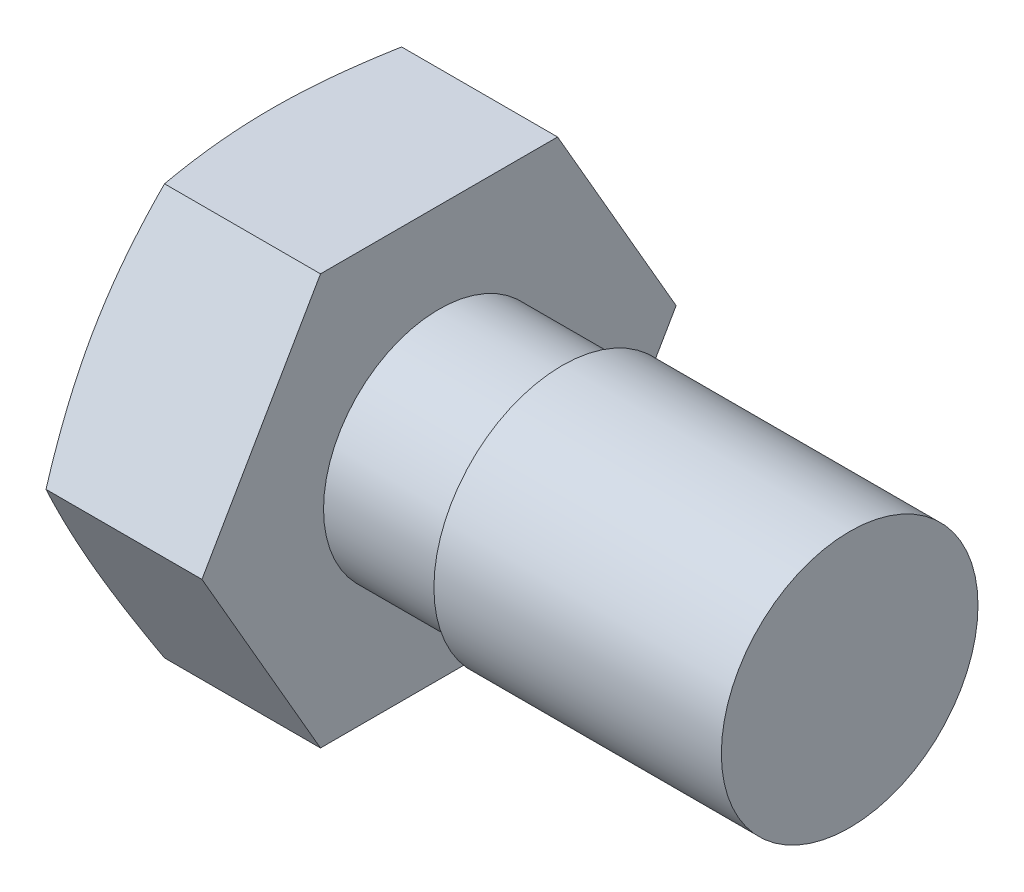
from build123d import *

# Parameters (mm, degrees)
BASEHEAD_DEPTH     = 3.5
SKETCH3_R          = 2.25
EXTRUDE2_DEPTH     = 2.4
SKETCH4_R          = 2.5
BASEBODY_DEPTH     = 5.6
SKETCH6_R          = 3.35
CUT_EXTRUDE1_DEPTH = 1.2
CUT_EXTRUDE2_DEPTH = 0.546
CIRPATTERN2_COUNT  = 2
CIRPATTERN2_ANGLE  = 90


with BuildPart() as part:
    # Sketch2 → BaseHead (new body)
    with BuildSketch(Plane(origin=(0, 0, 0), x_dir=(0, 0, -1), z_dir=(1, 0, 0))):
        Polygon((2.309401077, -4), (4.618802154, 0), (2.309401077, 4), (-2.309401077, 4), (-4.618802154, 0), (-2.309401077, -4), align=None)
    extrude(amount=BASEHEAD_DEPTH)

    # Sketch3 → Extrude2 (add)
    with BuildSketch(Plane(origin=(3.5, 0, 0), x_dir=(0, 0, -1), z_dir=(1, 0, 0))):
        with Locations(Location((0, 0, 0), (0, 0, 180))):
            Circle(SKETCH3_R)
    extrude(amount=EXTRUDE2_DEPTH)

    # Sketch4 → BaseBody (add)
    with BuildSketch(Plane(origin=(5.9, 0, 0), x_dir=(0, 0, -1), z_dir=(1, 0, 0))):
        with Locations(Location((0, 0, 0), (0, 0, 180))):
            Circle(SKETCH4_R)
    extrude(amount=BASEBODY_DEPTH)

    # Sketch5 → HeadChamfer (revolve, cut)
    with BuildSketch(Plane(origin=(0, 0, 0), x_dir=(1, 0, 0), z_dir=(0, 1, 0)), mode=Mode.PRIVATE) as headchamfer_sk:
        Polygon((0, 4.618802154), (0.461806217, 4.618802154), (0, 3.35), align=None)
    revolve(headchamfer_sk.sketch.rotate(Axis((-0.358389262, 0, 0), (1, 0, 0)), 180), axis=Axis((-0.358389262, 0, 0), (1, 0, 0)), mode=Mode.SUBTRACT)

    # Sketch6 → Cut-Extrude1 (cut)
    with BuildSketch(Plane.ZY):
        Circle(SKETCH6_R)
    extrude(amount=-CUT_EXTRUDE1_DEPTH, mode=Mode.SUBTRACT)

    # Sketch7 → Cut-Extrude2 (cut, symmetric)
    with BuildSketch(Plane(origin=(0, 0, 0), x_dir=(1, 0, 0), z_dir=(0, 1, 0))):
        Polygon((3.93, 0), (0.7, 2.83956044), (0.7, -2.83956044), align=None)
    cut_extrude2 = extrude(amount=CUT_EXTRUDE2_DEPTH, both=True, mode=Mode.SUBTRACT)

    # CirPattern2: Cut-Extrude2 ×2 about axis
    cirpattern2_axis = Axis((0, 0, 0), (-1, 0, 0))
    for i in range(1, CIRPATTERN2_COUNT):
        add(cut_extrude2.rotate(cirpattern2_axis, i * CIRPATTERN2_ANGLE / (CIRPATTERN2_COUNT - 1)), mode=Mode.SUBTRACT)


solid = part.part
